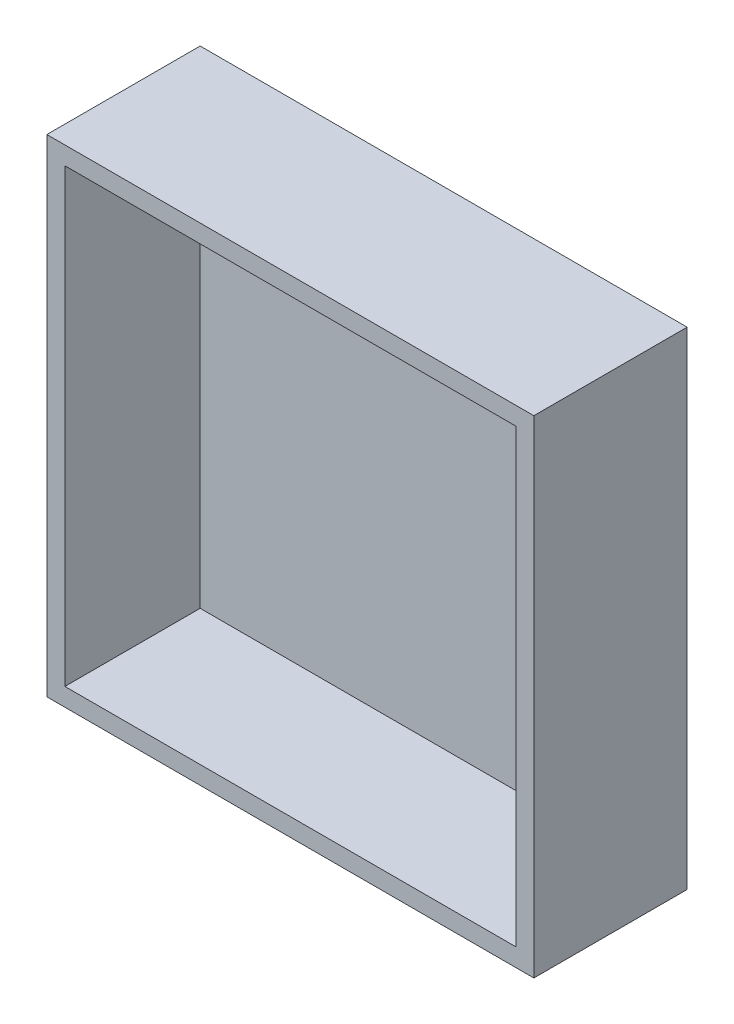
ISO-10303-21;
HEADER;
FILE_DESCRIPTION(('STEP AP214'),'2;1');
FILE_NAME('part.step','',(''),(''),'','','');
FILE_SCHEMA(('AUTOMOTIVE_DESIGN { 1 0 10303 214 1 1 1 1 }'));
ENDSEC;
DATA;
#1=APPLICATION_CONTEXT('core data for automotive mechanical design processes');
#2=APPLICATION_PROTOCOL_DEFINITION('international standard','automotive_design',2000,#1);
#3=PRODUCT_CONTEXT('',#1,'mechanical');
#4=PRODUCT('Part','Part','',(#3));
#5=PRODUCT_RELATED_PRODUCT_CATEGORY('part','',(#4));
#6=PRODUCT_DEFINITION_FORMATION('','',#4);
#7=PRODUCT_DEFINITION_CONTEXT('part definition',#1,'design');
#8=PRODUCT_DEFINITION('design','',#6,#7);
#9=PRODUCT_DEFINITION_SHAPE('','',#8);
#10=(LENGTH_UNIT() NAMED_UNIT(*) SI_UNIT(.MILLI.,.METRE.));
#11=(NAMED_UNIT(*) PLANE_ANGLE_UNIT() SI_UNIT($,.RADIAN.));
#12=(NAMED_UNIT(*) SI_UNIT($,.STERADIAN.) SOLID_ANGLE_UNIT());
#13=UNCERTAINTY_MEASURE_WITH_UNIT(LENGTH_MEASURE(1.E-05),#10,'distance_accuracy_value','');
#14=(GEOMETRIC_REPRESENTATION_CONTEXT(3) GLOBAL_UNCERTAINTY_ASSIGNED_CONTEXT((#13)) GLOBAL_UNIT_ASSIGNED_CONTEXT((#10,
#11,#12)) REPRESENTATION_CONTEXT('',''));
#15=CARTESIAN_POINT('',(0.,0.,0.));
#16=DIRECTION('',(0.,0.,1.));
#17=DIRECTION('',(1.,0.,0.));
#18=AXIS2_PLACEMENT_3D('',#15,#16,#17);
#19=CARTESIAN_POINT('',(-27.,-25.,15.));
#20=DIRECTION('',(1.,0.,0.));
#21=DIRECTION('',(0.,0.,-1.));
#22=AXIS2_PLACEMENT_3D('',#19,#20,#21);
#23=PLANE('',#22);
#24=DIRECTION('',(0.,-1.,0.));
#25=VECTOR('',#24,1.);
#26=CARTESIAN_POINT('',(-27.,-25.,-2.));
#27=LINE('',#26,#25);
#28=CARTESIAN_POINT('',(-27.,27.,-2.));
#29=VERTEX_POINT('',#28);
#30=CARTESIAN_POINT('',(-27.,-27.,-2.));
#31=VERTEX_POINT('',#30);
#32=EDGE_CURVE('E120',#29,#31,#27,.T.);
#33=ORIENTED_EDGE('',*,*,#32,.T.);
#34=DIRECTION('',(0.,0.,-1.));
#35=VECTOR('',#34,1.);
#36=CARTESIAN_POINT('',(-27.,-27.,15.));
#37=LINE('',#36,#35);
#38=CARTESIAN_POINT('',(-27.,-27.,15.));
#39=VERTEX_POINT('',#38);
#40=EDGE_CURVE('E11',#39,#31,#37,.T.);
#41=ORIENTED_EDGE('',*,*,#40,.F.);
#42=DIRECTION('',(0.,-1.,0.));
#43=VECTOR('',#42,1.);
#44=CARTESIAN_POINT('',(-27.,-25.,15.));
#45=LINE('',#44,#43);
#46=CARTESIAN_POINT('',(-27.,27.,15.));
#47=VERTEX_POINT('',#46);
#48=EDGE_CURVE('E156',#47,#39,#45,.T.);
#49=ORIENTED_EDGE('',*,*,#48,.F.);
#50=DIRECTION('',(0.,0.,-1.));
#51=VECTOR('',#50,1.);
#52=CARTESIAN_POINT('',(-27.,27.,15.));
#53=LINE('',#52,#51);
#54=EDGE_CURVE('E143',#47,#29,#53,.T.);
#55=ORIENTED_EDGE('',*,*,#54,.T.);
#56=EDGE_LOOP('',(#33,#41,#49,#55));
#57=FACE_BOUND('',#56,.T.);
#58=ADVANCED_FACE('F32',(#57),#23,.F.);
#59=CARTESIAN_POINT('',(25.,-27.,15.));
#60=DIRECTION('',(0.,1.,0.));
#61=DIRECTION('',(0.,0.,1.));
#62=AXIS2_PLACEMENT_3D('',#59,#60,#61);
#63=PLANE('',#62);
#64=DIRECTION('',(1.,0.,0.));
#65=VECTOR('',#64,1.);
#66=CARTESIAN_POINT('',(25.,-27.,-2.));
#67=LINE('',#66,#65);
#68=CARTESIAN_POINT('',(27.,-27.,-2.));
#69=VERTEX_POINT('',#68);
#70=EDGE_CURVE('E141',#31,#69,#67,.T.);
#71=ORIENTED_EDGE('',*,*,#70,.T.);
#72=DIRECTION('',(0.,0.,-1.));
#73=VECTOR('',#72,1.);
#74=CARTESIAN_POINT('',(27.,-27.,15.));
#75=LINE('',#74,#73);
#76=CARTESIAN_POINT('',(27.,-27.,15.));
#77=VERTEX_POINT('',#76);
#78=EDGE_CURVE('E41',#77,#69,#75,.T.);
#79=ORIENTED_EDGE('',*,*,#78,.F.);
#80=DIRECTION('',(1.,0.,0.));
#81=VECTOR('',#80,1.);
#82=CARTESIAN_POINT('',(25.,-27.,15.));
#83=LINE('',#82,#81);
#84=EDGE_CURVE('E158',#39,#77,#83,.T.);
#85=ORIENTED_EDGE('',*,*,#84,.F.);
#86=ORIENTED_EDGE('',*,*,#40,.T.);
#87=EDGE_LOOP('',(#71,#79,#85,#86));
#88=FACE_BOUND('',#87,.T.);
#89=ADVANCED_FACE('F174',(#88),#63,.F.);
#90=CARTESIAN_POINT('',(27.,-25.,15.));
#91=DIRECTION('',(-1.,0.,0.));
#92=DIRECTION('',(0.,0.,1.));
#93=AXIS2_PLACEMENT_3D('',#90,#91,#92);
#94=PLANE('',#93);
#95=DIRECTION('',(0.,1.,0.));
#96=VECTOR('',#95,1.);
#97=CARTESIAN_POINT('',(27.,-25.,-2.));
#98=LINE('',#97,#96);
#99=CARTESIAN_POINT('',(27.,27.,-2.));
#100=VERTEX_POINT('',#99);
#101=EDGE_CURVE('E148',#69,#100,#98,.T.);
#102=ORIENTED_EDGE('',*,*,#101,.T.);
#103=DIRECTION('',(0.,0.,-1.));
#104=VECTOR('',#103,1.);
#105=CARTESIAN_POINT('',(27.,27.,15.));
#106=LINE('',#105,#104);
#107=CARTESIAN_POINT('',(27.,27.,15.));
#108=VERTEX_POINT('',#107);
#109=EDGE_CURVE('E146',#108,#100,#106,.T.);
#110=ORIENTED_EDGE('',*,*,#109,.F.);
#111=DIRECTION('',(0.,1.,0.));
#112=VECTOR('',#111,1.);
#113=CARTESIAN_POINT('',(27.,-25.,15.));
#114=LINE('',#113,#112);
#115=EDGE_CURVE('E159',#77,#108,#114,.T.);
#116=ORIENTED_EDGE('',*,*,#115,.F.);
#117=ORIENTED_EDGE('',*,*,#78,.T.);
#118=EDGE_LOOP('',(#102,#110,#116,#117));
#119=FACE_BOUND('',#118,.T.);
#120=ADVANCED_FACE('F164',(#119),#94,.F.);
#121=CARTESIAN_POINT('',(25.,27.,15.));
#122=DIRECTION('',(0.,-1.,0.));
#123=DIRECTION('',(0.,0.,-1.));
#124=AXIS2_PLACEMENT_3D('',#121,#122,#123);
#125=PLANE('',#124);
#126=DIRECTION('',(-1.,0.,0.));
#127=VECTOR('',#126,1.);
#128=CARTESIAN_POINT('',(25.,27.,-2.));
#129=LINE('',#128,#127);
#130=EDGE_CURVE('E152',#100,#29,#129,.T.);
#131=ORIENTED_EDGE('',*,*,#130,.T.);
#132=ORIENTED_EDGE('',*,*,#54,.F.);
#133=DIRECTION('',(-1.,0.,0.));
#134=VECTOR('',#133,1.);
#135=CARTESIAN_POINT('',(25.,27.,15.));
#136=LINE('',#135,#134);
#137=EDGE_CURVE('E36',#108,#47,#136,.T.);
#138=ORIENTED_EDGE('',*,*,#137,.F.);
#139=ORIENTED_EDGE('',*,*,#109,.T.);
#140=EDGE_LOOP('',(#131,#132,#138,#139));
#141=FACE_BOUND('',#140,.T.);
#142=ADVANCED_FACE('F168',(#141),#125,.F.);
#143=CARTESIAN_POINT('',(0.,0.,15.));
#144=DIRECTION('',(0.,0.,1.));
#145=DIRECTION('',(1.,0.,0.));
#146=AXIS2_PLACEMENT_3D('',#143,#144,#145);
#147=PLANE('',#146);
#148=DIRECTION('',(0.,-1.,0.));
#149=VECTOR('',#148,1.);
#150=CARTESIAN_POINT('',(-25.,-25.,15.));
#151=LINE('',#150,#149);
#152=CARTESIAN_POINT('',(-25.,25.,15.));
#153=VERTEX_POINT('',#152);
#154=CARTESIAN_POINT('',(-25.,-25.,15.));
#155=VERTEX_POINT('',#154);
#156=EDGE_CURVE('E101',#153,#155,#151,.T.);
#157=ORIENTED_EDGE('',*,*,#156,.F.);
#158=DIRECTION('',(-1.,0.,0.));
#159=VECTOR('',#158,1.);
#160=CARTESIAN_POINT('',(25.,25.,15.));
#161=LINE('',#160,#159);
#162=CARTESIAN_POINT('',(25.,25.,15.));
#163=VERTEX_POINT('',#162);
#164=EDGE_CURVE('E127',#163,#153,#161,.T.);
#165=ORIENTED_EDGE('',*,*,#164,.F.);
#166=DIRECTION('',(0.,1.,0.));
#167=VECTOR('',#166,1.);
#168=CARTESIAN_POINT('',(25.,-25.,15.));
#169=LINE('',#168,#167);
#170=CARTESIAN_POINT('',(25.,-25.,15.));
#171=VERTEX_POINT('',#170);
#172=EDGE_CURVE('E125',#171,#163,#169,.T.);
#173=ORIENTED_EDGE('',*,*,#172,.F.);
#174=DIRECTION('',(1.,0.,0.));
#175=VECTOR('',#174,1.);
#176=CARTESIAN_POINT('',(25.,-25.,15.));
#177=LINE('',#176,#175);
#178=EDGE_CURVE('E112',#155,#171,#177,.T.);
#179=ORIENTED_EDGE('',*,*,#178,.F.);
#180=EDGE_LOOP('',(#157,#165,#173,#179));
#181=FACE_BOUND('',#180,.T.);
#182=ORIENTED_EDGE('',*,*,#48,.T.);
#183=ORIENTED_EDGE('',*,*,#84,.T.);
#184=ORIENTED_EDGE('',*,*,#115,.T.);
#185=ORIENTED_EDGE('',*,*,#137,.T.);
#186=EDGE_LOOP('',(#182,#183,#184,#185));
#187=FACE_BOUND('',#186,.T.);
#188=ADVANCED_FACE('F124',(#181,#187),#147,.T.);
#189=CARTESIAN_POINT('',(0.,0.,-2.));
#190=DIRECTION('',(0.,0.,1.));
#191=DIRECTION('',(1.,0.,0.));
#192=AXIS2_PLACEMENT_3D('',#189,#190,#191);
#193=PLANE('',#192);
#194=ORIENTED_EDGE('',*,*,#32,.F.);
#195=ORIENTED_EDGE('',*,*,#130,.F.);
#196=ORIENTED_EDGE('',*,*,#101,.F.);
#197=ORIENTED_EDGE('',*,*,#70,.F.);
#198=EDGE_LOOP('',(#194,#195,#196,#197));
#199=FACE_BOUND('',#198,.T.);
#200=ADVANCED_FACE('F34',(#199),#193,.F.);
#201=CARTESIAN_POINT('',(-25.,-25.,15.));
#202=DIRECTION('',(1.,0.,0.));
#203=DIRECTION('',(0.,0.,-1.));
#204=AXIS2_PLACEMENT_3D('',#201,#202,#203);
#205=PLANE('',#204);
#206=DIRECTION('',(0.,-1.,0.));
#207=VECTOR('',#206,1.);
#208=CARTESIAN_POINT('',(-25.,-25.,0.));
#209=LINE('',#208,#207);
#210=CARTESIAN_POINT('',(-25.,25.,0.));
#211=VERTEX_POINT('',#210);
#212=CARTESIAN_POINT('',(-25.,-25.,0.));
#213=VERTEX_POINT('',#212);
#214=EDGE_CURVE('E131',#211,#213,#209,.T.);
#215=ORIENTED_EDGE('',*,*,#214,.F.);
#216=DIRECTION('',(0.,0.,-1.));
#217=VECTOR('',#216,1.);
#218=CARTESIAN_POINT('',(-25.,25.,15.));
#219=LINE('',#218,#217);
#220=EDGE_CURVE('E108',#153,#211,#219,.T.);
#221=ORIENTED_EDGE('',*,*,#220,.F.);
#222=ORIENTED_EDGE('',*,*,#156,.T.);
#223=DIRECTION('',(0.,0.,-1.));
#224=VECTOR('',#223,1.);
#225=CARTESIAN_POINT('',(-25.,-25.,15.));
#226=LINE('',#225,#224);
#227=EDGE_CURVE('E105',#155,#213,#226,.T.);
#228=ORIENTED_EDGE('',*,*,#227,.T.);
#229=EDGE_LOOP('',(#215,#221,#222,#228));
#230=FACE_BOUND('',#229,.T.);
#231=ADVANCED_FACE('F104',(#230),#205,.T.);
#232=CARTESIAN_POINT('',(25.,-25.,15.));
#233=DIRECTION('',(0.,1.,0.));
#234=DIRECTION('',(0.,0.,1.));
#235=AXIS2_PLACEMENT_3D('',#232,#233,#234);
#236=PLANE('',#235);
#237=DIRECTION('',(1.,0.,0.));
#238=VECTOR('',#237,1.);
#239=CARTESIAN_POINT('',(25.,-25.,0.));
#240=LINE('',#239,#238);
#241=CARTESIAN_POINT('',(25.,-25.,0.));
#242=VERTEX_POINT('',#241);
#243=EDGE_CURVE('E119',#213,#242,#240,.T.);
#244=ORIENTED_EDGE('',*,*,#243,.F.);
#245=ORIENTED_EDGE('',*,*,#227,.F.);
#246=ORIENTED_EDGE('',*,*,#178,.T.);
#247=DIRECTION('',(0.,0.,-1.));
#248=VECTOR('',#247,1.);
#249=CARTESIAN_POINT('',(25.,-25.,15.));
#250=LINE('',#249,#248);
#251=EDGE_CURVE('E121',#171,#242,#250,.T.);
#252=ORIENTED_EDGE('',*,*,#251,.T.);
#253=EDGE_LOOP('',(#244,#245,#246,#252));
#254=FACE_BOUND('',#253,.T.);
#255=ADVANCED_FACE('F116',(#254),#236,.T.);
#256=CARTESIAN_POINT('',(25.,-25.,15.));
#257=DIRECTION('',(-1.,0.,0.));
#258=DIRECTION('',(0.,0.,1.));
#259=AXIS2_PLACEMENT_3D('',#256,#257,#258);
#260=PLANE('',#259);
#261=DIRECTION('',(0.,1.,0.));
#262=VECTOR('',#261,1.);
#263=CARTESIAN_POINT('',(25.,-25.,0.));
#264=LINE('',#263,#262);
#265=CARTESIAN_POINT('',(25.,25.,0.));
#266=VERTEX_POINT('',#265);
#267=EDGE_CURVE('E134',#242,#266,#264,.T.);
#268=ORIENTED_EDGE('',*,*,#267,.F.);
#269=ORIENTED_EDGE('',*,*,#251,.F.);
#270=ORIENTED_EDGE('',*,*,#172,.T.);
#271=DIRECTION('',(0.,0.,-1.));
#272=VECTOR('',#271,1.);
#273=CARTESIAN_POINT('',(25.,25.,15.));
#274=LINE('',#273,#272);
#275=EDGE_CURVE('E49',#163,#266,#274,.T.);
#276=ORIENTED_EDGE('',*,*,#275,.T.);
#277=EDGE_LOOP('',(#268,#269,#270,#276));
#278=FACE_BOUND('',#277,.T.);
#279=ADVANCED_FACE('F219',(#278),#260,.T.);
#280=CARTESIAN_POINT('',(25.,25.,15.));
#281=DIRECTION('',(0.,-1.,0.));
#282=DIRECTION('',(0.,0.,-1.));
#283=AXIS2_PLACEMENT_3D('',#280,#281,#282);
#284=PLANE('',#283);
#285=DIRECTION('',(-1.,0.,0.));
#286=VECTOR('',#285,1.);
#287=CARTESIAN_POINT('',(25.,25.,0.));
#288=LINE('',#287,#286);
#289=EDGE_CURVE('E113',#266,#211,#288,.T.);
#290=ORIENTED_EDGE('',*,*,#289,.F.);
#291=ORIENTED_EDGE('',*,*,#275,.F.);
#292=ORIENTED_EDGE('',*,*,#164,.T.);
#293=ORIENTED_EDGE('',*,*,#220,.T.);
#294=EDGE_LOOP('',(#290,#291,#292,#293));
#295=FACE_BOUND('',#294,.T.);
#296=ADVANCED_FACE('F228',(#295),#284,.T.);
#297=CARTESIAN_POINT('',(0.,0.,0.));
#298=DIRECTION('',(0.,0.,1.));
#299=DIRECTION('',(1.,0.,0.));
#300=AXIS2_PLACEMENT_3D('',#297,#298,#299);
#301=PLANE('',#300);
#302=ORIENTED_EDGE('',*,*,#214,.T.);
#303=ORIENTED_EDGE('',*,*,#243,.T.);
#304=ORIENTED_EDGE('',*,*,#267,.T.);
#305=ORIENTED_EDGE('',*,*,#289,.T.);
#306=EDGE_LOOP('',(#302,#303,#304,#305));
#307=FACE_BOUND('',#306,.T.);
#308=ADVANCED_FACE('F238',(#307),#301,.T.);
#309=CLOSED_SHELL('',(#58,#89,#120,#142,#188,#200,#231,#255,#279,#296,#308));
#310=MANIFOLD_SOLID_BREP('B2',#309);
#311=ADVANCED_BREP_SHAPE_REPRESENTATION('',(#18,#310),#14);
#312=SHAPE_DEFINITION_REPRESENTATION(#9,#311);
ENDSEC;
END-ISO-10303-21;
